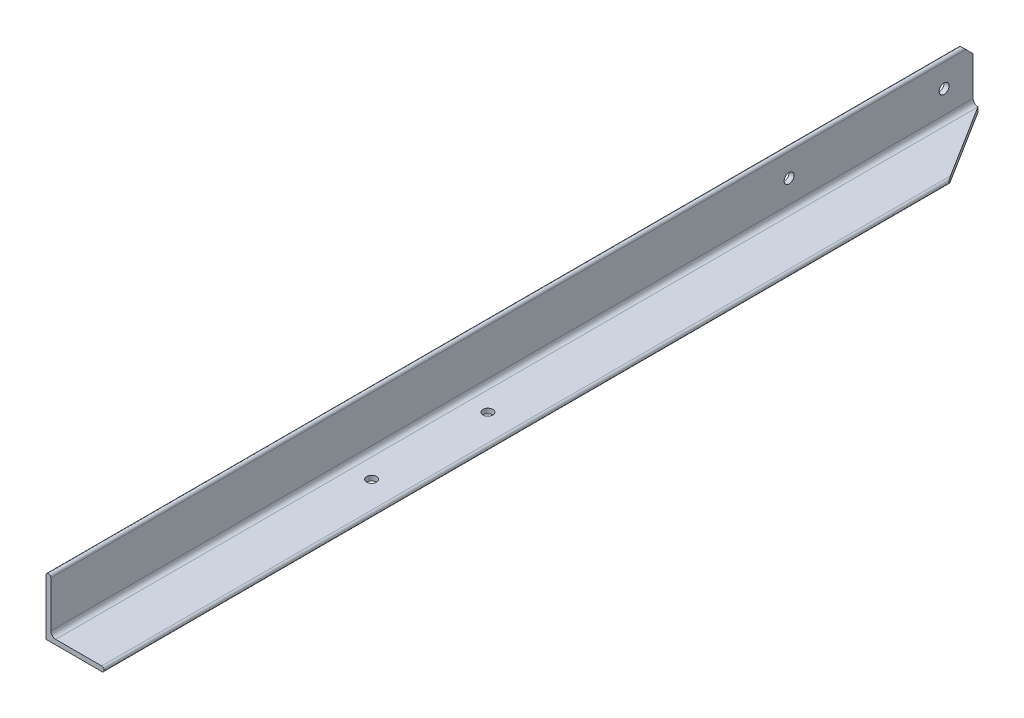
from build123d import *

# Parameters (mm, degrees)
BOSS_EXTRUDE1_DEPTH     = 302.24603
SKETCH5_R               = 3.2385
CUT_EXTRUDE3_DEPTH      = 307.633377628
CUT_EXTRUDE4_DEPTH      = 307.633377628
CUT_EXTRUDE5_DEPTH      = 308.011209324
CUT_EXTRUDE5_DEPTH_BACK = 308.011209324
SKETCH7_R               = 3.2385


with BuildPart() as part:
    # Sketch1 → Boss-Extrude1 (new, symmetric)
    with BuildSketch(Plane.XY):
        with BuildLine():
            Line((0, 0), (0, 36.5125))
            ThreePointArc((0, 36.5125), (1.5875, 38.1), (3.175, 36.5125))
            Line((3.175, 36.5125), (3.175, 6.35))
            ThreePointArc((3.175, 6.35), (4.10493597, 4.10493597), (6.35, 3.175))
            Line((6.35, 3.175), (36.5125, 3.175))
            ThreePointArc((36.5125, 3.175), (38.1, 1.5875), (36.5125, 0))
            Line((36.5125, 0), (0, 0))
        make_face()
    extrude(amount=BOSS_EXTRUDE1_DEPTH, both=True)

    # Sketch5 → Cut-Extrude3 (cut, through all)
    with BuildSketch(Plane(origin=(3.175, 0, 0), x_dir=(0, 0, -1), z_dir=(1, 0, 0))):
        with Locations((283.19603, 21.43125)):
            Circle(SKETCH5_R)
        with Locations((181.59603, 21.43125)):
            Circle(SKETCH5_R)
        Polygon((302.24603, 38.1), (302.24603, 31.75), (295.89603, 38.1), align=None)
    extrude(amount=-CUT_EXTRUDE3_DEPTH, mode=Mode.SUBTRACT)

    # Sketch6 → Cut-Extrude4 (cut, through all)
    with BuildSketch(Plane(origin=(0, 3.175, 0), x_dir=(1, 0, 0), z_dir=(0, 1, 0))):
        Polygon((38.1, 302.24603), (6.35, 302.24603), (38.1, 251.44603), align=None)
    extrude(amount=-CUT_EXTRUDE4_DEPTH, mode=Mode.SUBTRACT)

    # Sketch7 → Cut-Extrude5 (cut, two sides: drawn at the far end of the back side and taken through both)
    with BuildSketch(Plane.XZ.offset(-CUT_EXTRUDE5_DEPTH_BACK)):
        with Locations((19.05, 31.68853442)):
            Circle(SKETCH7_R)
        with Locations((19.05, 107.88853442)):
            Circle(SKETCH7_R)
    extrude(amount=CUT_EXTRUDE5_DEPTH + CUT_EXTRUDE5_DEPTH_BACK, mode=Mode.SUBTRACT)


solid = part.part
